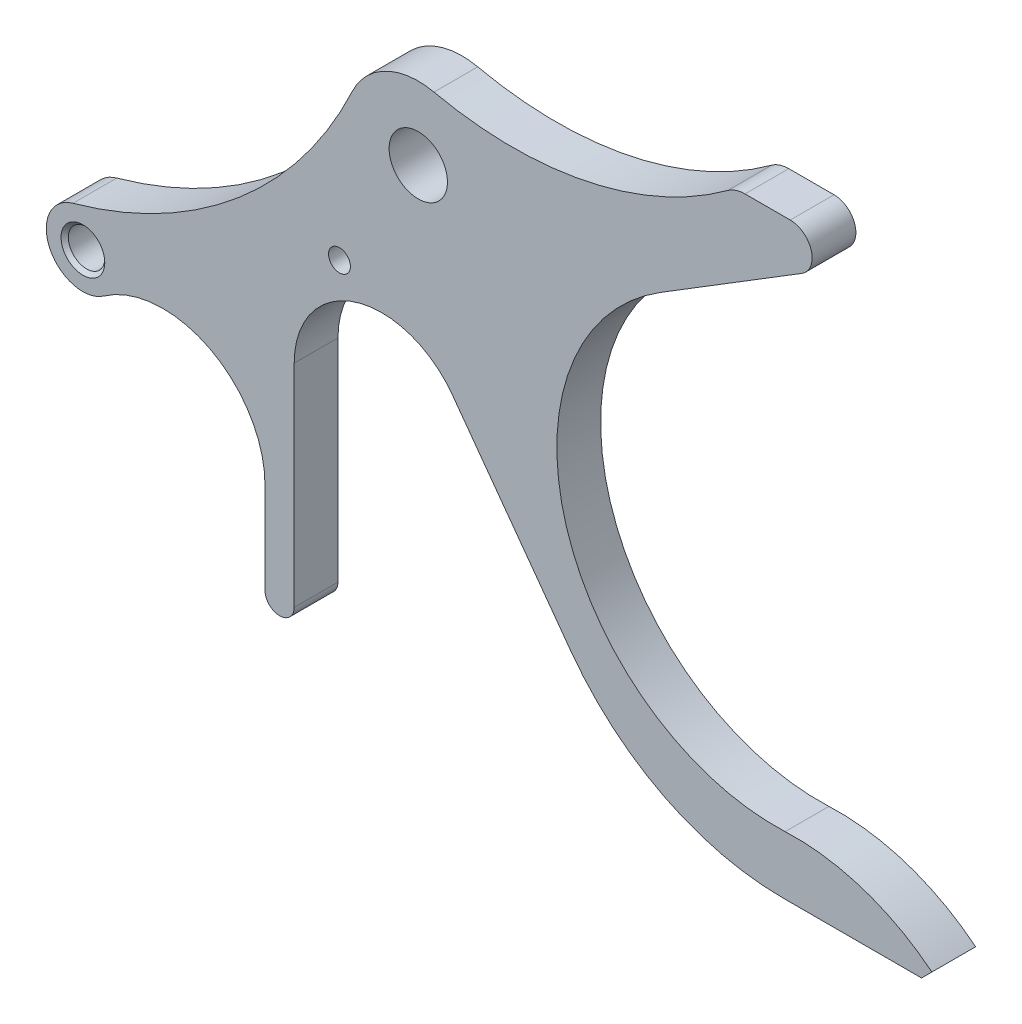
from build123d import *

# Parameters (mm, degrees)
EXTRUSION1_DEPTH                = 3
ESQUISSE2_R                     = 2
ENL_V_MAT_EXTRU_1_DEPTH         = 48.338909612
TROU_TARAUD_M3X0_52_D           = 2.5
TROU_TARAUD_M3X0_52_DEPTH       = 7.5
TROU_TARAUD_M3X0_52_CSINK_D     = 3
TROU_TARAUD_M3X0_52_CSINK_ANGLE = 90
TROU_TARAUD_M3X0_52_TIP         = 0.751075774
ESQUISSE6_R                     = 0.75
ENL_V_MAT_EXTRU_2_DEPTH         = 10


with BuildPart() as part:
    # Esquisse1 → Extrusion1 (new body)
    with BuildSketch(Plane.XY):
        with BuildLine():
            Line((-10.505684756, -24.25), (-10.505684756, -30.5))
            ThreePointArc((-10.505684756, -30.5), (-9.505684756, -31.5), (-8.505684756, -30.5))
            Line((-8.505684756, -30.5), (-8.505684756, -16))
            ThreePointArc((-8.505684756, -16), (-4.363089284, -10.294735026), (2.344331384, -12.467671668))
            Line((2.344331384, -12.467671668), (10.44995158, -23.596984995))
            ThreePointArc((10.44995158, -23.596984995), (16.837455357, -29.042844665), (25, -31))
            Line((25, -31), (34.5, -31))
            Line((34.5, -31), (35.209691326, -30.290308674))
            ThreePointArc((35.209691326, -30.290308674), (30.481112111, -27.72095383), (25.15, -26.985910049))
            ThreePointArc((25.15, -26.985910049), (10.160678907, -16.402711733), (16.628324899, 0.768583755))
            Line((16.628324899, 0.768583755), (26.28716751, 6.723141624))
            ThreePointArc((26.28716751, 6.723141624), (26.943136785, 8.409091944), (25.5, 9.5))
            Line((25.5, 9.5), (22.4, 9.5))
            ThreePointArc((22.4, 9.5), (21.77909113, 9.401176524), (21.219542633, 9.114472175))
            ThreePointArc((21.219542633, 9.114472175), (11.60412929, 4.829535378), (1.077304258, 4.882562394))
            ThreePointArc((1.077304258, 4.882562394), (-2.212352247, 4.483915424), (-4.530276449, 2.115796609))
            ThreePointArc((-4.530276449, 2.115796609), (-12.32529445, -8.083924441), (-23.670148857, -14.091494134))
            ThreePointArc((-23.670148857, -14.091494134), (-25.257557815, -17.573979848), (-21.554127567, -18.539473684))
            ThreePointArc((-21.554127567, -18.539473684), (-14.29158299, -18.031515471), (-10.505684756, -24.25))
        make_face()
    extrude(amount=EXTRUSION1_DEPTH)

    # Esquisse2 → Enl_v. mat.-Extru.1 (cut, through all)
    with BuildSketch(Plane.XY.offset(3)):
        Circle(ESQUISSE2_R)
    extrude(amount=-ENL_V_MAT_EXTRU_1_DEPTH, mode=Mode.SUBTRACT)

    # Trou taraud_ M3x0.52
    with Locations(Plane(origin=(-22.990038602, -16.523222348, 3), x_dir=(1, 0, 0), z_dir=(0, 0, 1))):
        with Locations((0, 0)):
            CounterSinkHole(TROU_TARAUD_M3X0_52_D / 2, TROU_TARAUD_M3X0_52_CSINK_D / 2, depth=TROU_TARAUD_M3X0_52_DEPTH, counter_sink_angle=TROU_TARAUD_M3X0_52_CSINK_ANGLE)
            with Locations((0, 0, -(TROU_TARAUD_M3X0_52_DEPTH + TROU_TARAUD_M3X0_52_TIP / 2))):  # 118° drill point
                Cone(0, TROU_TARAUD_M3X0_52_D / 2, TROU_TARAUD_M3X0_52_TIP, mode=Mode.SUBTRACT)

    # Esquisse6 → Enl_v. mat.-Extru.2 (cut)
    with BuildSketch(Plane.XY.offset(3)):
        with Locations((-5.4, -8.34)):
            Circle(ESQUISSE6_R)
    extrude(amount=-ENL_V_MAT_EXTRU_2_DEPTH, mode=Mode.SUBTRACT)


solid = part.part
